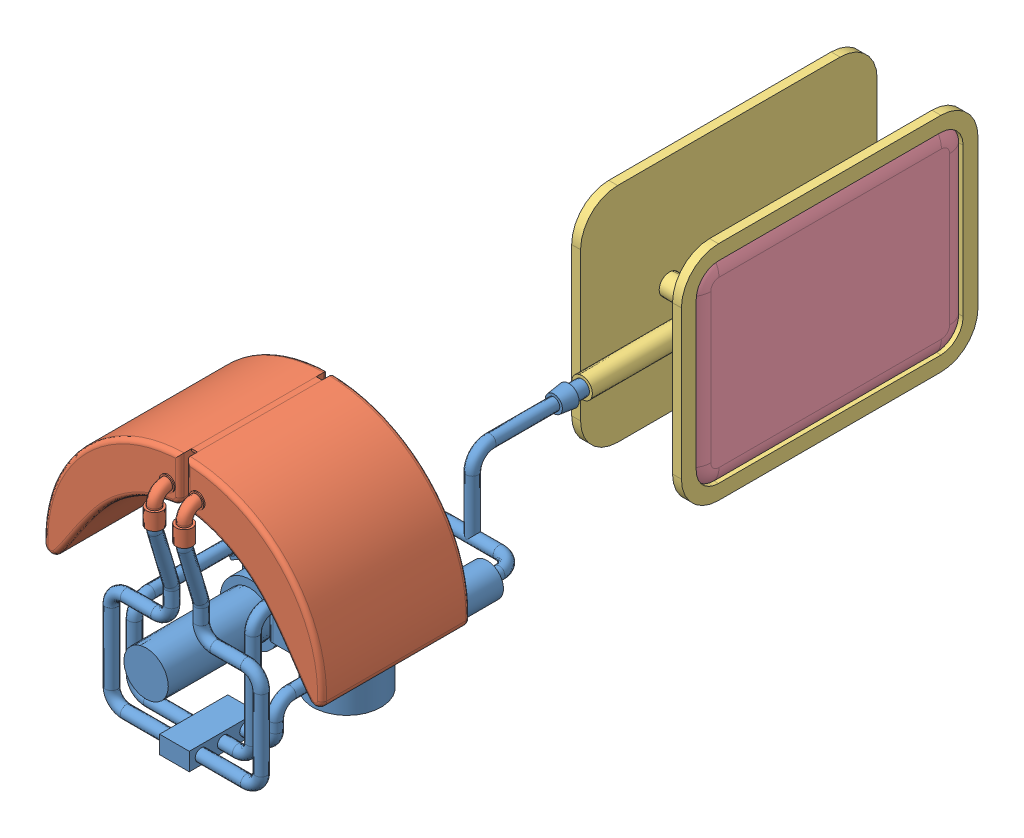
SolidWorks assembly pompe_equipee.SLDASM, configuration Défaut (file format 4400). Lengths in mm.
Overall size (188 176.25 513.78).
6 component instances, 4 part files, 6 mates.
Components (placement in the parent):
- ens_pompe_1-1: ens_pompe_1.SLDPRT [Défaut] at origin size (110.87 143.96 282.28)
- reservoirs_internes-1: reservoirs_internes.SLDPRT [Défaut] at (30 50 75.2758) x (-1 0 0) z (0 0 -1) size (188 108.69 119.33)
- ballast_ext-2: ballast_ext.SLDASM [Défaut] at (30 50 -284) x (0 0 -1) z (1 0 0) size (230 150 74.7)
  - ballasts_ext_cadre-1: ballasts_ext_cadre.SLDPRT [Défaut] at origin size (230 150 74)
  - ballasts_ext_reservoir-1: ballasts_ext_reservoir.SLDPRT [Défaut] at (40 0 34) size (180 130 3.35)
  - ballasts_ext_reservoir-2: ballasts_ext_reservoir.SLDPRT [Défaut] at (40 0 -34) x (-1 0 0) z (0 0 -1) size (180 130 3.35)
Mates (geometry in assembly coordinates):
- Coïncidente1: coincident anti-aligned: axis of ens_pompe_1-1 through (30 50 -132) axis (0 0 -1); axis of reservoirs_internes-1 through (30 50 -21.7242) axis (0 0 1)
- Parallèle1: parallel aligned: plane of ens_pompe_1-1 through (55 45 -40.4851) normal (0 1 0); plane of reservoirs_internes-1 through (32 143.9787 67.2758) normal (0 1 0)
- Coïncidente3: coincident aligned: cylinder of ens_pompe_1-1 through (40 103.4183 84.2758) axis (0 1 0) radius 4; circle of reservoirs_internes-1
- Parallèle3: parallel aligned: plane of ens_pompe_1-1 through (85 45 -40.4851) normal (1 0 0); plane of ballast_ext-2/ballasts_ext_reservoir-1 through (67.35 0 -399) normal (1 0 0)
- Coïncidente7: coincident anti-aligned: plane of ens_pompe_1-1 through (30 50 -194) normal (0 0 -1); plane of ballast_ext-2/ballasts_ext_cadre-1 through (30 50 -194) normal (0 0 1)
- Coaxiale3: concentric aligned: cylinder of ens_pompe_1-1 through (30 50 -194) axis (0 0 1) radius 5; cylinder of ballast_ext-2/ballasts_ext_cadre-1 through (30 50 -296) axis (0 0 1) radius 7
